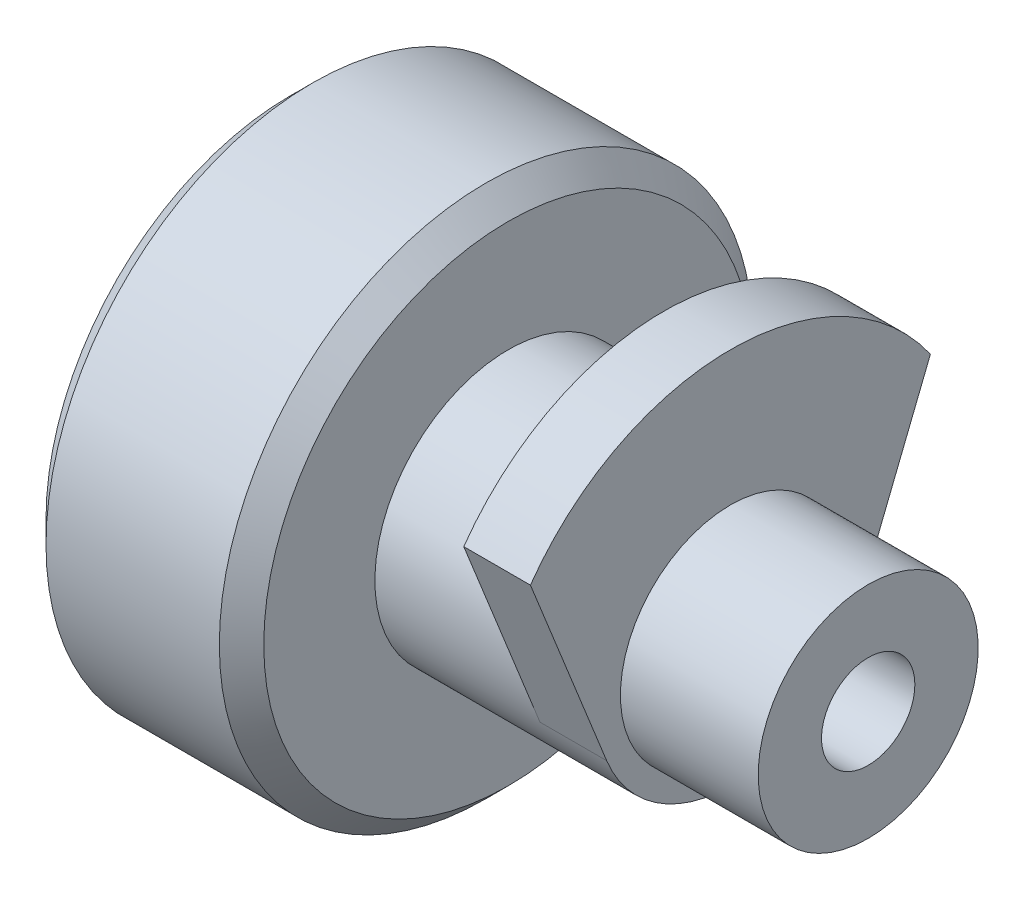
from build123d import *

# Parameters (mm, degrees)
M5_TAPPED_HOLE1_D     = 4.2
M5_TAPPED_HOLE1_DEPTH = 14
M5_TAPPED_HOLE1_TIP   = 1.2618073
EXTRUDE1_START        = -3
EXTRUDE1_DEPTH        = 3


with BuildPart() as part:
    # Sketch1 → Revolve1 (revolve)
    with BuildSketch(Plane.XY, mode=Mode.PRIVATE) as revolve1_sk:
        Polygon((16.8, 0), (26, 0), (26, 4.95), (19.8, 4.95), (19.8, 6), (9.8, 6), (9.8, 11), (8.8, 12), (1, 12), (0, 11), (0, 2.5), (16.8, 2.5), align=None)
    revolve(revolve1_sk.sketch.rotate(Axis((16.8, 0, 0), (1, 0, 0)), 180), axis=Axis((16.8, 0, 0), (1, 0, 0)))

    # M5 Tapped Hole1
    with Locations(Plane.YZ.offset(26)):
        with Locations((0, 0)):
            Hole(M5_TAPPED_HOLE1_D / 2, depth=M5_TAPPED_HOLE1_DEPTH)
            with Locations((0, 0, -(M5_TAPPED_HOLE1_DEPTH + M5_TAPPED_HOLE1_TIP / 2))):  # 118° drill point
                Cone(0, M5_TAPPED_HOLE1_D / 2, M5_TAPPED_HOLE1_TIP, mode=Mode.SUBTRACT)

    # Sketch3 → Extrude1 (add)
    with BuildSketch(Plane(origin=(19.8, 0, 0), x_dir=(0, 0, -1), z_dir=(1, 0, 0)).offset(EXTRUDE1_START)):
        with BuildLine():
            Line((9, 6.32455532), (5.569067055, -2.232821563))
            ThreePointArc((5.569067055, -2.232821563), (0, -6), (-5.569067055, -2.232821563))
            Line((-5.569067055, -2.232821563), (-9, 6.32455532))
            ThreePointArc((-9, 6.32455532), (0, 11), (9, 6.32455532))
        make_face()
    extrude(amount=EXTRUDE1_DEPTH)


solid = part.part
